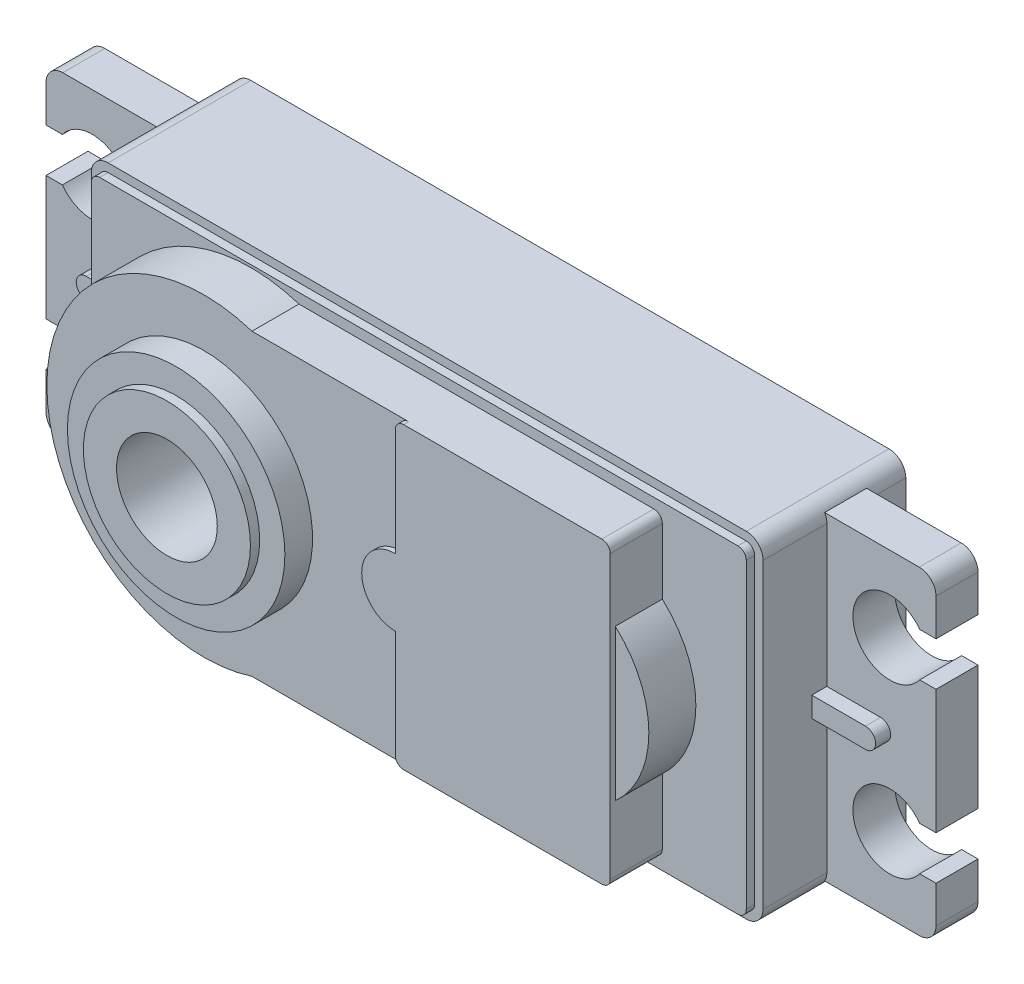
from build123d import *

# Parameters (mm, degrees)
Z_KLAD_PROTA_EN_DEPTH    = 8.5
P_ID_N_PROTA_EN_1_DEPTH  = 0.5
P_ID_N_PROTA_EN_2_DEPTH  = 2.8
P_ID_N_PROTA_EN_3_DEPTH  = 0.3
SKICA5_R                 = 6.475
P_ID_N_PROTA_EN_5_DEPTH  = 1.65
SKICA6_R                 = 4.975
P_ID_N_PROTA_EN_6_DEPTH  = 0.55
SKICA7_R                 = 3
ODEBR_N_PROTA_EN_1_DEPTH = 27.381811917
P_ID_N_PROTA_EN_7_DEPTH  = 2.5
P_ID_N_PROTA_EN_8_DEPTH  = 0.9


with BuildPart() as part:
    # Skica1 → Z_klad-Prota_en (new body)
    with BuildSketch(Plane.XY):
        with BuildLine():
            Line((-19, -10), (19, -10))
            ThreePointArc((19, -10), (19.707106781, -9.707106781), (20, -9))
            Line((20, -9), (20, 9))
            ThreePointArc((20, 9), (19.707106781, 9.707106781), (19, 10))
            Line((19, 10), (-19, 10))
            ThreePointArc((-19, 10), (-19.707106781, 9.707106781), (-20, 9))
            Line((-20, 9), (-20, -9))
            ThreePointArc((-20, -9), (-19.707106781, -9.707106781), (-19, -10))
        make_face()
    extrude(amount=Z_KLAD_PROTA_EN_DEPTH)

    # Skica2 → P_id_n_-Prota_en_1 (add)
    with BuildSketch(Plane.XY.offset(8.5)):
        with BuildLine():
            Line((-19, -9.5), (19, -9.5))
            ThreePointArc((19, -9.5), (19.353553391, -9.353553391), (19.5, -9))
            Line((19.5, -9), (19.5, 9))
            ThreePointArc((19.5, 9), (19.353553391, 9.353553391), (19, 9.5))
            Line((19, 9.5), (-19, 9.5))
            ThreePointArc((-19, 9.5), (-19.353553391, 9.353553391), (-19.5, 9))
            Line((-19.5, 9), (-19.5, -9))
            ThreePointArc((-19.5, -9), (-19.353553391, -9.353553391), (-19, -9.5))
        make_face()
    extrude(amount=P_ID_N_PROTA_EN_1_DEPTH)

    # Skica3 → P_id_n_-Prota_en_2 (add)
    with BuildSketch(Plane.XY.offset(9)):
        with BuildLine():
            Line((-7.134254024, 8.9), (14, 8.9))
            ThreePointArc((14, 8.9), (14.353553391, 8.753553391), (14.5, 8.4))
            Line((14.5, 8.4), (14.5, 4.5))
            ThreePointArc((14.5, 4.5), (16.5, 0), (14.5, -4.5))
            Line((14.5, -4.5), (14.5, -8.4))
            ThreePointArc((14.5, -8.4), (14.353553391, -8.753553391), (14, -8.9))
            Line((14, -8.9), (-7.134254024, -8.9))
            ThreePointArc((-7.134254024, -8.9), (-19.35, 0), (-7.134254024, 8.9))
        make_face()
    extrude(amount=P_ID_N_PROTA_EN_2_DEPTH)

    # Skica4 → P_id_n_-Prota_en_3 (add)
    with BuildSketch(Plane.XY.offset(11.8)):
        with BuildLine():
            Line((1.7, -8.4), (1.7, -2))
            ThreePointArc((1.7, -2), (-0.3, 0), (1.7, 2))
            Line((1.7, 2), (1.7, 8.4))
            ThreePointArc((1.7, 8.4), (1.846446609, 8.753553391), (2.2, 8.9))
            Line((2.2, 8.9), (14, 8.9))
            ThreePointArc((14, 8.9), (14.353553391, 8.753553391), (14.5, 8.4))
            Line((14.5, 8.4), (14.5, -8.4))
            ThreePointArc((14.5, -8.4), (14.353553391, -8.753553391), (14, -8.9))
            Line((14, -8.9), (2.2, -8.9))
            ThreePointArc((2.2, -8.9), (1.846446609, -8.753553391), (1.7, -8.4))
        make_face()
    extrude(amount=P_ID_N_PROTA_EN_3_DEPTH)

    # Skica5 → P_id_n_-Prota_en_5 (add)
    with BuildSketch(Plane.XY.offset(11.8)):
        with Locations(Location((-10, 0, 0), (0, 0, 180))):
            Circle(SKICA5_R)
    extrude(amount=P_ID_N_PROTA_EN_5_DEPTH)

    # Skica6 → P_id_n_-Prota_en_6 (add)
    with BuildSketch(Plane.XY.offset(13.45)):
        with Locations((-10, 0)):
            Circle(SKICA6_R)
    extrude(amount=P_ID_N_PROTA_EN_6_DEPTH)

    # Skica7 → Odebr_n_-Prota_en_1 (cut, through all)
    with BuildSketch(Plane.XY.offset(14)):
        with Locations((-10, 0)):
            Circle(SKICA7_R)
    extrude(amount=-ODEBR_N_PROTA_EN_1_DEPTH, mode=Mode.SUBTRACT)

    # Skica8 → P_id_n_-Prota_en_7 (add)
    with BuildSketch(Plane(origin=(0, 0, 2.2), x_dir=(-1, 0, 0), z_dir=(0, 0, -1))):
        with BuildLine():
            Line((19.866025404, 9.5), (25.5, 9.5))
            ThreePointArc((25.5, 9.5), (26.207106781, 9.207106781), (26.5, 8.5))
            Line((26.5, 8.5), (26.5, 6.3))
            Line((26.5, 6.3), (25.524823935, 6.3))
            ThreePointArc((25.524823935, 6.3), (21.55, 5), (25.524823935, 3.7))
            Line((25.524823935, 3.7), (26.5, 3.7))
            Line((26.5, 3.7), (26.5, -3.7))
            Line((26.5, -3.7), (25.524823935, -3.7))
            ThreePointArc((25.524823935, -3.7), (21.55, -5), (25.524823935, -6.3))
            Line((25.524823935, -6.3), (26.5, -6.3))
            Line((26.5, -6.3), (26.5, -8.5))
            ThreePointArc((26.5, -8.5), (26.207106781, -9.207106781), (25.5, -9.5))
            Line((25.5, -9.5), (19.866025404, -9.5))
            Line((19.866025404, -9.5), (19.866025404, 9.5))
        make_face()
    p_id_n_prota_en_7 = extrude(amount=-P_ID_N_PROTA_EN_7_DEPTH)

    # Skica9 → P_id_n_-Prota_en_8 (add)
    with BuildSketch(Plane.XY.offset(4.7)):
        with BuildLine():
            Line((-20, 0.6), (-23.2, 0.6))
            ThreePointArc((-23.2, 0.6), (-23.8, 0), (-23.2, -0.6))
            Line((-23.2, -0.6), (-20, -0.6))
            Line((-20, -0.6), (-20, 0.6))
        make_face()
    p_id_n_prota_en_8 = extrude(amount=P_ID_N_PROTA_EN_8_DEPTH)

    # Zrcadlen_1: P_id_n_-Prota_en_7, P_id_n_-Prota_en_8 across plane
    add(p_id_n_prota_en_7.mirror(Plane(origin=(0, 0, 0), x_dir=(0, 0, 1), z_dir=(1, 0, 0))))
    add(p_id_n_prota_en_8.mirror(Plane(origin=(0, 0, 0), x_dir=(0, 0, 1), z_dir=(1, 0, 0))))


solid = part.part
